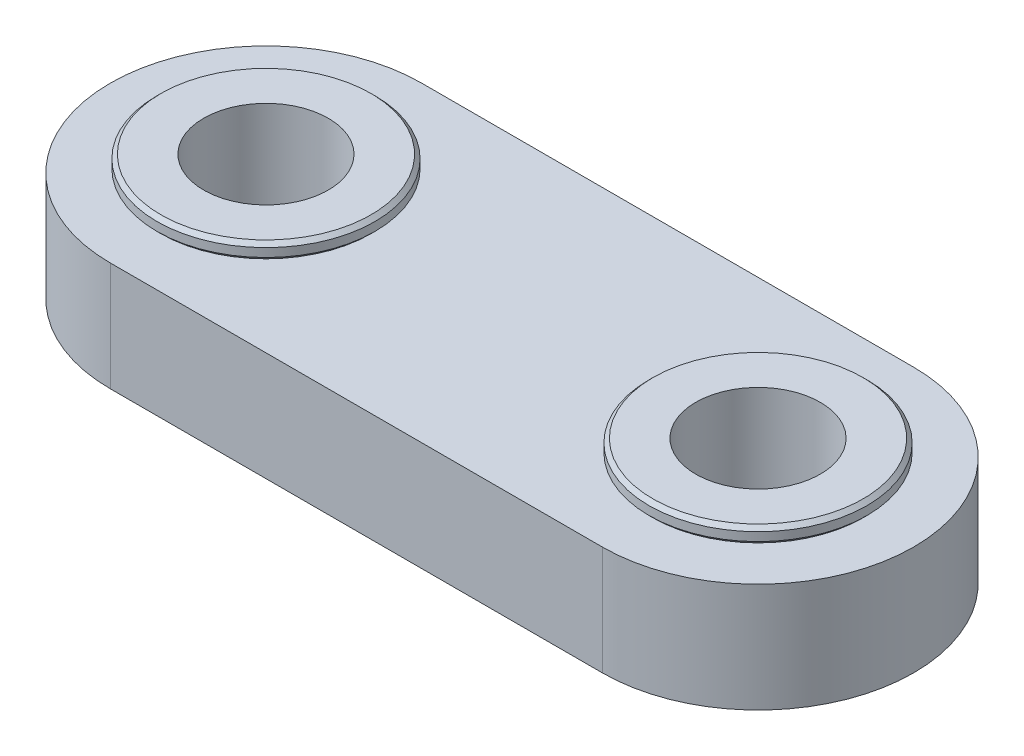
ISO-10303-21;
HEADER;
FILE_DESCRIPTION(('STEP AP214'),'2;1');
FILE_NAME('part.step','',(''),(''),'','','');
FILE_SCHEMA(('AUTOMOTIVE_DESIGN { 1 0 10303 214 1 1 1 1 }'));
ENDSEC;
DATA;
#1=APPLICATION_CONTEXT('core data for automotive mechanical design processes');
#2=APPLICATION_PROTOCOL_DEFINITION('international standard','automotive_design',2000,#1);
#3=PRODUCT_CONTEXT('',#1,'mechanical');
#4=PRODUCT('Part','Part','',(#3));
#5=PRODUCT_RELATED_PRODUCT_CATEGORY('part','',(#4));
#6=PRODUCT_DEFINITION_FORMATION('','',#4);
#7=PRODUCT_DEFINITION_CONTEXT('part definition',#1,'design');
#8=PRODUCT_DEFINITION('design','',#6,#7);
#9=PRODUCT_DEFINITION_SHAPE('','',#8);
#10=(LENGTH_UNIT() NAMED_UNIT(*) SI_UNIT(.MILLI.,.METRE.));
#11=(NAMED_UNIT(*) PLANE_ANGLE_UNIT() SI_UNIT($,.RADIAN.));
#12=(NAMED_UNIT(*) SI_UNIT($,.STERADIAN.) SOLID_ANGLE_UNIT());
#13=UNCERTAINTY_MEASURE_WITH_UNIT(LENGTH_MEASURE(1.E-05),#10,'distance_accuracy_value','');
#14=(GEOMETRIC_REPRESENTATION_CONTEXT(3) GLOBAL_UNCERTAINTY_ASSIGNED_CONTEXT((#13)) GLOBAL_UNIT_ASSIGNED_CONTEXT((#10,
#11,#12)) REPRESENTATION_CONTEXT('',''));
#15=CARTESIAN_POINT('',(0.,0.,0.));
#16=DIRECTION('',(0.,0.,1.));
#17=DIRECTION('',(1.,0.,0.));
#18=AXIS2_PLACEMENT_3D('',#15,#16,#17);
#19=CARTESIAN_POINT('',(0.,0.,0.));
#20=DIRECTION('',(0.,-1.,0.));
#21=DIRECTION('',(-1.,0.,0.));
#22=AXIS2_PLACEMENT_3D('',#19,#20,#21);
#23=CYLINDRICAL_SURFACE('',#22,10.);
#24=CARTESIAN_POINT('',(0.,-3.5,0.));
#25=DIRECTION('',(0.,1.,0.));
#26=DIRECTION('',(1.,0.,0.));
#27=AXIS2_PLACEMENT_3D('',#24,#25,#26);
#28=CIRCLE('',#27,10.);
#29=CARTESIAN_POINT('',(0.,-3.5,-10.));
#30=VERTEX_POINT('',#29);
#31=CARTESIAN_POINT('',(0.,-3.5,10.));
#32=VERTEX_POINT('',#31);
#33=EDGE_CURVE('E59',#30,#32,#28,.T.);
#34=ORIENTED_EDGE('',*,*,#33,.T.);
#35=DIRECTION('',(0.,-1.,0.));
#36=VECTOR('',#35,1.);
#37=CARTESIAN_POINT('',(0.,0.,10.));
#38=LINE('',#37,#36);
#39=CARTESIAN_POINT('',(0.,3.5,10.));
#40=VERTEX_POINT('',#39);
#41=EDGE_CURVE('E64',#40,#32,#38,.T.);
#42=ORIENTED_EDGE('',*,*,#41,.F.);
#43=CARTESIAN_POINT('',(0.,3.5,0.));
#44=DIRECTION('',(0.,1.,0.));
#45=DIRECTION('',(1.,0.,0.));
#46=AXIS2_PLACEMENT_3D('',#43,#44,#45);
#47=CIRCLE('',#46,10.);
#48=CARTESIAN_POINT('',(0.,3.5,-10.));
#49=VERTEX_POINT('',#48);
#50=EDGE_CURVE('E98',#49,#40,#47,.T.);
#51=ORIENTED_EDGE('',*,*,#50,.F.);
#52=DIRECTION('',(0.,-1.,0.));
#53=VECTOR('',#52,1.);
#54=CARTESIAN_POINT('',(0.,0.,-10.));
#55=LINE('',#54,#53);
#56=EDGE_CURVE('E66',#49,#30,#55,.T.);
#57=ORIENTED_EDGE('',*,*,#56,.T.);
#58=EDGE_LOOP('',(#34,#42,#51,#57));
#59=FACE_BOUND('',#58,.T.);
#60=ADVANCED_FACE('F14',(#59),#23,.T.);
#61=CARTESIAN_POINT('',(0.,0.,10.));
#62=DIRECTION('',(0.,0.,-1.));
#63=DIRECTION('',(0.,1.,0.));
#64=AXIS2_PLACEMENT_3D('',#61,#62,#63);
#65=PLANE('',#64);
#66=DIRECTION('',(1.,0.,0.));
#67=VECTOR('',#66,1.);
#68=CARTESIAN_POINT('',(0.,-3.5,10.));
#69=LINE('',#68,#67);
#70=CARTESIAN_POINT('',(31.6,-3.5,10.));
#71=VERTEX_POINT('',#70);
#72=EDGE_CURVE('E69',#32,#71,#69,.T.);
#73=ORIENTED_EDGE('',*,*,#72,.T.);
#74=DIRECTION('',(0.,-1.,0.));
#75=VECTOR('',#74,1.);
#76=CARTESIAN_POINT('',(31.6,0.,10.));
#77=LINE('',#76,#75);
#78=CARTESIAN_POINT('',(31.6,3.5,10.));
#79=VERTEX_POINT('',#78);
#80=EDGE_CURVE('E47',#79,#71,#77,.T.);
#81=ORIENTED_EDGE('',*,*,#80,.F.);
#82=DIRECTION('',(1.,0.,0.));
#83=VECTOR('',#82,1.);
#84=CARTESIAN_POINT('',(0.,3.5,10.));
#85=LINE('',#84,#83);
#86=EDGE_CURVE('E73',#40,#79,#85,.T.);
#87=ORIENTED_EDGE('',*,*,#86,.F.);
#88=ORIENTED_EDGE('',*,*,#41,.T.);
#89=EDGE_LOOP('',(#73,#81,#87,#88));
#90=FACE_BOUND('',#89,.T.);
#91=ADVANCED_FACE('F72',(#90),#65,.F.);
#92=CARTESIAN_POINT('',(31.6,0.,0.));
#93=DIRECTION('',(0.,-1.,0.));
#94=DIRECTION('',(-1.,0.,0.));
#95=AXIS2_PLACEMENT_3D('',#92,#93,#94);
#96=CYLINDRICAL_SURFACE('',#95,10.);
#97=CARTESIAN_POINT('',(31.6,-3.5,0.));
#98=DIRECTION('',(0.,1.,0.));
#99=DIRECTION('',(-1.,0.,0.));
#100=AXIS2_PLACEMENT_3D('',#97,#98,#99);
#101=CIRCLE('',#100,10.);
#102=CARTESIAN_POINT('',(31.6,-3.5,-10.));
#103=VERTEX_POINT('',#102);
#104=EDGE_CURVE('E31',#71,#103,#101,.T.);
#105=ORIENTED_EDGE('',*,*,#104,.T.);
#106=DIRECTION('',(0.,-1.,0.));
#107=VECTOR('',#106,1.);
#108=CARTESIAN_POINT('',(31.6,0.,-10.));
#109=LINE('',#108,#107);
#110=CARTESIAN_POINT('',(31.6,3.5,-10.));
#111=VERTEX_POINT('',#110);
#112=EDGE_CURVE('E51',#111,#103,#109,.T.);
#113=ORIENTED_EDGE('',*,*,#112,.F.);
#114=CARTESIAN_POINT('',(31.6,3.5,0.));
#115=DIRECTION('',(0.,1.,0.));
#116=DIRECTION('',(-1.,0.,0.));
#117=AXIS2_PLACEMENT_3D('',#114,#115,#116);
#118=CIRCLE('',#117,10.);
#119=EDGE_CURVE('E102',#79,#111,#118,.T.);
#120=ORIENTED_EDGE('',*,*,#119,.F.);
#121=ORIENTED_EDGE('',*,*,#80,.T.);
#122=EDGE_LOOP('',(#105,#113,#120,#121));
#123=FACE_BOUND('',#122,.T.);
#124=ADVANCED_FACE('F255',(#123),#96,.T.);
#125=CARTESIAN_POINT('',(31.6,0.,-10.));
#126=DIRECTION('',(0.,0.,1.));
#127=DIRECTION('',(0.,-1.,0.));
#128=AXIS2_PLACEMENT_3D('',#125,#126,#127);
#129=PLANE('',#128);
#130=DIRECTION('',(-1.,0.,0.));
#131=VECTOR('',#130,1.);
#132=CARTESIAN_POINT('',(31.6,-3.5,-10.));
#133=LINE('',#132,#131);
#134=EDGE_CURVE('E70',#103,#30,#133,.T.);
#135=ORIENTED_EDGE('',*,*,#134,.T.);
#136=ORIENTED_EDGE('',*,*,#56,.F.);
#137=DIRECTION('',(-1.,0.,0.));
#138=VECTOR('',#137,1.);
#139=CARTESIAN_POINT('',(31.6,3.5,-10.));
#140=LINE('',#139,#138);
#141=EDGE_CURVE('E100',#111,#49,#140,.T.);
#142=ORIENTED_EDGE('',*,*,#141,.F.);
#143=ORIENTED_EDGE('',*,*,#112,.T.);
#144=EDGE_LOOP('',(#135,#136,#142,#143));
#145=FACE_BOUND('',#144,.T.);
#146=ADVANCED_FACE('F252',(#145),#129,.F.);
#147=CARTESIAN_POINT('',(0.,-3.5,0.));
#148=DIRECTION('',(0.,1.,0.));
#149=DIRECTION('',(1.,0.,0.));
#150=AXIS2_PLACEMENT_3D('',#147,#148,#149);
#151=PLANE('',#150);
#152=CARTESIAN_POINT('',(31.6,-3.5,-4.44089209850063E-13));
#153=DIRECTION('',(0.,1.,0.));
#154=DIRECTION('',(1.,0.,0.));
#155=AXIS2_PLACEMENT_3D('',#152,#153,#154);
#156=CIRCLE('',#155,7.3);
#157=CARTESIAN_POINT('',(38.9,-3.5,-4.44089209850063E-13));
#158=VERTEX_POINT('',#157);
#159=EDGE_CURVE('E91',#158,#158,#156,.F.);
#160=ORIENTED_EDGE('',*,*,#159,.F.);
#161=EDGE_LOOP('',(#160));
#162=FACE_BOUND('',#161,.T.);
#163=ORIENTED_EDGE('',*,*,#134,.F.);
#164=ORIENTED_EDGE('',*,*,#104,.F.);
#165=ORIENTED_EDGE('',*,*,#72,.F.);
#166=ORIENTED_EDGE('',*,*,#33,.F.);
#167=EDGE_LOOP('',(#163,#164,#165,#166));
#168=FACE_BOUND('',#167,.T.);
#169=CARTESIAN_POINT('',(0.,-3.5,0.));
#170=DIRECTION('',(0.,1.,0.));
#171=DIRECTION('',(1.,0.,0.));
#172=AXIS2_PLACEMENT_3D('',#169,#170,#171);
#173=CIRCLE('',#172,7.3);
#174=CARTESIAN_POINT('',(7.3,-3.5,0.));
#175=VERTEX_POINT('',#174);
#176=EDGE_CURVE('E94',#175,#175,#173,.F.);
#177=ORIENTED_EDGE('',*,*,#176,.F.);
#178=EDGE_LOOP('',(#177));
#179=FACE_BOUND('',#178,.T.);
#180=ADVANCED_FACE('F75',(#162,#168,#179),#151,.F.);
#181=CARTESIAN_POINT('',(31.6,-3.5,-4.44089209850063E-13));
#182=DIRECTION('',(0.,-1.,0.));
#183=DIRECTION('',(1.,0.,0.));
#184=AXIS2_PLACEMENT_3D('',#181,#182,#183);
#185=CYLINDRICAL_SURFACE('',#184,7.5);
#186=CARTESIAN_POINT('',(31.6,-4.3,-4.44089209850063E-13));
#187=DIRECTION('',(0.,1.,0.));
#188=DIRECTION('',(1.,0.,0.));
#189=AXIS2_PLACEMENT_3D('',#186,#187,#188);
#190=CIRCLE('',#189,7.5);
#191=CARTESIAN_POINT('',(39.1,-4.3,-4.44089209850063E-13));
#192=VERTEX_POINT('',#191);
#193=EDGE_CURVE('E136',#192,#192,#190,.T.);
#194=ORIENTED_EDGE('',*,*,#193,.T.);
#195=EDGE_LOOP('',(#194));
#196=FACE_BOUND('',#195,.T.);
#197=CARTESIAN_POINT('',(31.6,-3.7,-4.44089209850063E-13));
#198=DIRECTION('',(0.,-1.,0.));
#199=DIRECTION('',(1.,0.,0.));
#200=AXIS2_PLACEMENT_3D('',#197,#198,#199);
#201=CIRCLE('',#200,7.5);
#202=CARTESIAN_POINT('',(39.1,-3.7,-4.44089209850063E-13));
#203=VERTEX_POINT('',#202);
#204=EDGE_CURVE('E120',#203,#203,#201,.T.);
#205=ORIENTED_EDGE('',*,*,#204,.T.);
#206=EDGE_LOOP('',(#205));
#207=FACE_BOUND('',#206,.T.);
#208=ADVANCED_FACE('F167',(#196,#207),#185,.T.);
#209=CARTESIAN_POINT('',(31.6,-3.5,-4.44089209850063E-13));
#210=DIRECTION('',(0.,-1.,0.));
#211=DIRECTION('',(1.,0.,0.));
#212=AXIS2_PLACEMENT_3D('',#209,#210,#211);
#213=CONICAL_SURFACE('',#212,7.3,0.785398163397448);
#214=ORIENTED_EDGE('',*,*,#204,.F.);
#215=EDGE_LOOP('',(#214));
#216=FACE_BOUND('',#215,.T.);
#217=ORIENTED_EDGE('',*,*,#159,.T.);
#218=EDGE_LOOP('',(#217));
#219=FACE_BOUND('',#218,.T.);
#220=ADVANCED_FACE('F164',(#216,#219),#213,.T.);
#221=CARTESIAN_POINT('',(0.,-3.5,0.));
#222=DIRECTION('',(0.,-1.,0.));
#223=DIRECTION('',(1.,0.,0.));
#224=AXIS2_PLACEMENT_3D('',#221,#222,#223);
#225=CYLINDRICAL_SURFACE('',#224,7.5);
#226=CARTESIAN_POINT('',(0.,-4.3,0.));
#227=DIRECTION('',(0.,1.,0.));
#228=DIRECTION('',(1.,0.,0.));
#229=AXIS2_PLACEMENT_3D('',#226,#227,#228);
#230=CIRCLE('',#229,7.5);
#231=CARTESIAN_POINT('',(7.5,-4.3,0.));
#232=VERTEX_POINT('',#231);
#233=EDGE_CURVE('E97',#232,#232,#230,.T.);
#234=ORIENTED_EDGE('',*,*,#233,.T.);
#235=EDGE_LOOP('',(#234));
#236=FACE_BOUND('',#235,.T.);
#237=CARTESIAN_POINT('',(0.,-3.7,0.));
#238=DIRECTION('',(0.,-1.,0.));
#239=DIRECTION('',(1.,0.,0.));
#240=AXIS2_PLACEMENT_3D('',#237,#238,#239);
#241=CIRCLE('',#240,7.5);
#242=CARTESIAN_POINT('',(7.5,-3.7,0.));
#243=VERTEX_POINT('',#242);
#244=EDGE_CURVE('E117',#243,#243,#241,.T.);
#245=ORIENTED_EDGE('',*,*,#244,.T.);
#246=EDGE_LOOP('',(#245));
#247=FACE_BOUND('',#246,.T.);
#248=ADVANCED_FACE('F166',(#236,#247),#225,.T.);
#249=CARTESIAN_POINT('',(0.,-3.5,0.));
#250=DIRECTION('',(0.,-1.,0.));
#251=DIRECTION('',(1.,0.,0.));
#252=AXIS2_PLACEMENT_3D('',#249,#250,#251);
#253=CONICAL_SURFACE('',#252,7.3,0.785398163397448);
#254=ORIENTED_EDGE('',*,*,#244,.F.);
#255=EDGE_LOOP('',(#254));
#256=FACE_BOUND('',#255,.T.);
#257=ORIENTED_EDGE('',*,*,#176,.T.);
#258=EDGE_LOOP('',(#257));
#259=FACE_BOUND('',#258,.T.);
#260=ADVANCED_FACE('F175',(#256,#259),#253,.T.);
#261=CARTESIAN_POINT('',(0.,-4.6,0.));
#262=DIRECTION('',(0.,1.,0.));
#263=DIRECTION('',(-1.,0.,0.));
#264=AXIS2_PLACEMENT_3D('',#261,#262,#263);
#265=CYLINDRICAL_SURFACE('',#264,7.);
#266=CARTESIAN_POINT('',(0.,4.3,0.));
#267=DIRECTION('',(0.,-1.,0.));
#268=DIRECTION('',(-1.,0.,0.));
#269=AXIS2_PLACEMENT_3D('',#266,#267,#268);
#270=CIRCLE('',#269,7.);
#271=CARTESIAN_POINT('',(-7.,4.3,0.));
#272=VERTEX_POINT('',#271);
#273=EDGE_CURVE('E23',#272,#272,#270,.T.);
#274=ORIENTED_EDGE('',*,*,#273,.T.);
#275=EDGE_LOOP('',(#274));
#276=FACE_BOUND('',#275,.T.);
#277=CARTESIAN_POINT('',(0.,3.75,0.));
#278=DIRECTION('',(0.,1.,0.));
#279=DIRECTION('',(-1.,0.,0.));
#280=AXIS2_PLACEMENT_3D('',#277,#278,#279);
#281=CIRCLE('',#280,7.);
#282=CARTESIAN_POINT('',(-7.,3.75,0.));
#283=VERTEX_POINT('',#282);
#284=EDGE_CURVE('E107',#283,#283,#281,.T.);
#285=ORIENTED_EDGE('',*,*,#284,.T.);
#286=EDGE_LOOP('',(#285));
#287=FACE_BOUND('',#286,.T.);
#288=ADVANCED_FACE('F150',(#276,#287),#265,.T.);
#289=CARTESIAN_POINT('',(31.6,-4.6,-4.44089209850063E-13));
#290=DIRECTION('',(0.,1.,0.));
#291=DIRECTION('',(-1.,0.,0.));
#292=AXIS2_PLACEMENT_3D('',#289,#290,#291);
#293=CYLINDRICAL_SURFACE('',#292,7.);
#294=CARTESIAN_POINT('',(31.6,4.3,-4.44089209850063E-13));
#295=DIRECTION('',(0.,-1.,0.));
#296=DIRECTION('',(-1.,0.,0.));
#297=AXIS2_PLACEMENT_3D('',#294,#295,#296);
#298=CIRCLE('',#297,7.);
#299=CARTESIAN_POINT('',(24.6,4.3,-4.44089209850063E-13));
#300=VERTEX_POINT('',#299);
#301=EDGE_CURVE('E142',#300,#300,#298,.T.);
#302=ORIENTED_EDGE('',*,*,#301,.T.);
#303=EDGE_LOOP('',(#302));
#304=FACE_BOUND('',#303,.T.);
#305=CARTESIAN_POINT('',(31.6,3.75,-4.44089209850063E-13));
#306=DIRECTION('',(0.,1.,0.));
#307=DIRECTION('',(-1.,0.,0.));
#308=AXIS2_PLACEMENT_3D('',#305,#306,#307);
#309=CIRCLE('',#308,7.);
#310=CARTESIAN_POINT('',(24.6,3.75,-4.44089209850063E-13));
#311=VERTEX_POINT('',#310);
#312=EDGE_CURVE('E114',#311,#311,#309,.T.);
#313=ORIENTED_EDGE('',*,*,#312,.T.);
#314=EDGE_LOOP('',(#313));
#315=FACE_BOUND('',#314,.T.);
#316=ADVANCED_FACE('F223',(#304,#315),#293,.T.);
#317=CARTESIAN_POINT('',(0.,3.5,0.));
#318=DIRECTION('',(0.,1.,0.));
#319=DIRECTION('',(-1.,0.,0.));
#320=AXIS2_PLACEMENT_3D('',#317,#318,#319);
#321=CONICAL_SURFACE('',#320,6.75,0.785398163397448);
#322=ORIENTED_EDGE('',*,*,#284,.F.);
#323=EDGE_LOOP('',(#322));
#324=FACE_BOUND('',#323,.T.);
#325=CARTESIAN_POINT('',(0.,3.5,0.));
#326=DIRECTION('',(0.,1.,0.));
#327=DIRECTION('',(1.,0.,0.));
#328=AXIS2_PLACEMENT_3D('',#325,#326,#327);
#329=CIRCLE('',#328,6.75);
#330=CARTESIAN_POINT('',(6.75,3.5,0.));
#331=VERTEX_POINT('',#330);
#332=EDGE_CURVE('E87',#331,#331,#329,.F.);
#333=ORIENTED_EDGE('',*,*,#332,.F.);
#334=EDGE_LOOP('',(#333));
#335=FACE_BOUND('',#334,.T.);
#336=ADVANCED_FACE('F219',(#324,#335),#321,.T.);
#337=CARTESIAN_POINT('',(31.6,3.5,-4.44089209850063E-13));
#338=DIRECTION('',(0.,1.,0.));
#339=DIRECTION('',(-1.,0.,0.));
#340=AXIS2_PLACEMENT_3D('',#337,#338,#339);
#341=CONICAL_SURFACE('',#340,6.75,0.785398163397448);
#342=ORIENTED_EDGE('',*,*,#312,.F.);
#343=EDGE_LOOP('',(#342));
#344=FACE_BOUND('',#343,.T.);
#345=CARTESIAN_POINT('',(31.6,3.5,-4.44089209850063E-13));
#346=DIRECTION('',(0.,1.,0.));
#347=DIRECTION('',(1.,0.,0.));
#348=AXIS2_PLACEMENT_3D('',#345,#346,#347);
#349=CIRCLE('',#348,6.75);
#350=CARTESIAN_POINT('',(38.35,3.5,-4.44089209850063E-13));
#351=VERTEX_POINT('',#350);
#352=EDGE_CURVE('E104',#351,#351,#349,.F.);
#353=ORIENTED_EDGE('',*,*,#352,.F.);
#354=EDGE_LOOP('',(#353));
#355=FACE_BOUND('',#354,.T.);
#356=ADVANCED_FACE('F212',(#344,#355),#341,.T.);
#357=CARTESIAN_POINT('',(0.,3.5,0.));
#358=DIRECTION('',(0.,1.,0.));
#359=DIRECTION('',(1.,0.,0.));
#360=AXIS2_PLACEMENT_3D('',#357,#358,#359);
#361=PLANE('',#360);
#362=ORIENTED_EDGE('',*,*,#352,.T.);
#363=EDGE_LOOP('',(#362));
#364=FACE_BOUND('',#363,.T.);
#365=ORIENTED_EDGE('',*,*,#141,.T.);
#366=ORIENTED_EDGE('',*,*,#50,.T.);
#367=ORIENTED_EDGE('',*,*,#86,.T.);
#368=ORIENTED_EDGE('',*,*,#119,.T.);
#369=EDGE_LOOP('',(#365,#366,#367,#368));
#370=FACE_BOUND('',#369,.T.);
#371=ORIENTED_EDGE('',*,*,#332,.T.);
#372=EDGE_LOOP('',(#371));
#373=FACE_BOUND('',#372,.T.);
#374=ADVANCED_FACE('F206',(#364,#370,#373),#361,.T.);
#375=CARTESIAN_POINT('',(0.,-4.6,0.));
#376=DIRECTION('',(0.,1.,0.));
#377=DIRECTION('',(-1.,0.,0.));
#378=AXIS2_PLACEMENT_3D('',#375,#376,#377);
#379=CYLINDRICAL_SURFACE('',#378,4.);
#380=CARTESIAN_POINT('',(0.,4.55,0.));
#381=DIRECTION('',(0.,-1.,0.));
#382=DIRECTION('',(-1.,0.,0.));
#383=AXIS2_PLACEMENT_3D('',#380,#381,#382);
#384=CIRCLE('',#383,4.);
#385=CARTESIAN_POINT('',(-4.,4.55,0.));
#386=VERTEX_POINT('',#385);
#387=EDGE_CURVE('E127',#386,#386,#384,.F.);
#388=ORIENTED_EDGE('',*,*,#387,.T.);
#389=EDGE_LOOP('',(#388));
#390=FACE_BOUND('',#389,.T.);
#391=CARTESIAN_POINT('',(0.,-4.55,0.));
#392=DIRECTION('',(0.,1.,0.));
#393=DIRECTION('',(1.,0.,0.));
#394=AXIS2_PLACEMENT_3D('',#391,#392,#393);
#395=CIRCLE('',#394,4.);
#396=CARTESIAN_POINT('',(4.,-4.55,0.));
#397=VERTEX_POINT('',#396);
#398=EDGE_CURVE('E123',#397,#397,#395,.F.);
#399=ORIENTED_EDGE('',*,*,#398,.T.);
#400=EDGE_LOOP('',(#399));
#401=FACE_BOUND('',#400,.T.);
#402=ADVANCED_FACE('F178',(#390,#401),#379,.F.);
#403=CARTESIAN_POINT('',(31.6,-4.6,-4.44089209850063E-13));
#404=DIRECTION('',(0.,1.,0.));
#405=DIRECTION('',(-1.,0.,0.));
#406=AXIS2_PLACEMENT_3D('',#403,#404,#405);
#407=CYLINDRICAL_SURFACE('',#406,4.);
#408=CARTESIAN_POINT('',(31.6,4.55,-4.44089209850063E-13));
#409=DIRECTION('',(0.,-1.,0.));
#410=DIRECTION('',(-1.,0.,0.));
#411=AXIS2_PLACEMENT_3D('',#408,#409,#410);
#412=CIRCLE('',#411,4.);
#413=CARTESIAN_POINT('',(27.6,4.55,-4.44089209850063E-13));
#414=VERTEX_POINT('',#413);
#415=EDGE_CURVE('E128',#414,#414,#412,.F.);
#416=ORIENTED_EDGE('',*,*,#415,.T.);
#417=EDGE_LOOP('',(#416));
#418=FACE_BOUND('',#417,.T.);
#419=CARTESIAN_POINT('',(31.6,-4.55,-4.44089209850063E-13));
#420=DIRECTION('',(0.,1.,0.));
#421=DIRECTION('',(1.,0.,0.));
#422=AXIS2_PLACEMENT_3D('',#419,#420,#421);
#423=CIRCLE('',#422,4.);
#424=CARTESIAN_POINT('',(35.6,-4.55,-4.44089209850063E-13));
#425=VERTEX_POINT('',#424);
#426=EDGE_CURVE('E124',#425,#425,#423,.F.);
#427=ORIENTED_EDGE('',*,*,#426,.T.);
#428=EDGE_LOOP('',(#427));
#429=FACE_BOUND('',#428,.T.);
#430=ADVANCED_FACE('F204',(#418,#429),#407,.F.);
#431=CARTESIAN_POINT('',(-9.02572077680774,-4.55,10.));
#432=DIRECTION('',(0.,1.,0.));
#433=DIRECTION('',(1.,0.,0.));
#434=AXIS2_PLACEMENT_3D('',#431,#432,#433);
#435=PLANE('',#434);
#436=CARTESIAN_POINT('',(31.6,-4.55,-4.44089209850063E-13));
#437=DIRECTION('',(0.,1.,0.));
#438=DIRECTION('',(1.,0.,0.));
#439=AXIS2_PLACEMENT_3D('',#436,#437,#438);
#440=CIRCLE('',#439,7.25);
#441=CARTESIAN_POINT('',(38.85,-4.55,-4.44089209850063E-13));
#442=VERTEX_POINT('',#441);
#443=EDGE_CURVE('E139',#442,#442,#440,.F.);
#444=ORIENTED_EDGE('',*,*,#443,.T.);
#445=EDGE_LOOP('',(#444));
#446=FACE_BOUND('',#445,.T.);
#447=ORIENTED_EDGE('',*,*,#426,.F.);
#448=EDGE_LOOP('',(#447));
#449=FACE_BOUND('',#448,.T.);
#450=ADVANCED_FACE('F200',(#446,#449),#435,.F.);
#451=CARTESIAN_POINT('',(0.,-4.55,0.));
#452=DIRECTION('',(0.,1.,0.));
#453=DIRECTION('',(1.,0.,0.));
#454=AXIS2_PLACEMENT_3D('',#451,#452,#453);
#455=CIRCLE('',#454,7.25);
#456=CARTESIAN_POINT('',(7.25,-4.55,0.));
#457=VERTEX_POINT('',#456);
#458=EDGE_CURVE('E133',#457,#457,#455,.F.);
#459=ORIENTED_EDGE('',*,*,#458,.T.);
#460=EDGE_LOOP('',(#459));
#461=FACE_BOUND('',#460,.T.);
#462=ORIENTED_EDGE('',*,*,#398,.F.);
#463=EDGE_LOOP('',(#462));
#464=FACE_BOUND('',#463,.T.);
#465=ADVANCED_FACE('F203',(#461,#464),#435,.F.);
#466=CARTESIAN_POINT('',(-9.02572077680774,4.55,10.));
#467=DIRECTION('',(0.,-1.,0.));
#468=DIRECTION('',(-1.,0.,0.));
#469=AXIS2_PLACEMENT_3D('',#466,#467,#468);
#470=PLANE('',#469);
#471=CARTESIAN_POINT('',(31.6,4.55,-4.44089209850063E-13));
#472=DIRECTION('',(0.,-1.,0.));
#473=DIRECTION('',(-1.,0.,0.));
#474=AXIS2_PLACEMENT_3D('',#471,#472,#473);
#475=CIRCLE('',#474,6.75);
#476=CARTESIAN_POINT('',(24.85,4.55,-4.44089209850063E-13));
#477=VERTEX_POINT('',#476);
#478=EDGE_CURVE('E145',#477,#477,#475,.F.);
#479=ORIENTED_EDGE('',*,*,#478,.T.);
#480=EDGE_LOOP('',(#479));
#481=FACE_BOUND('',#480,.T.);
#482=ORIENTED_EDGE('',*,*,#415,.F.);
#483=EDGE_LOOP('',(#482));
#484=FACE_BOUND('',#483,.T.);
#485=ADVANCED_FACE('F267',(#481,#484),#470,.F.);
#486=CARTESIAN_POINT('',(0.,4.55,0.));
#487=DIRECTION('',(0.,-1.,0.));
#488=DIRECTION('',(-1.,0.,0.));
#489=AXIS2_PLACEMENT_3D('',#486,#487,#488);
#490=CIRCLE('',#489,6.75);
#491=CARTESIAN_POINT('',(-6.75,4.55,0.));
#492=VERTEX_POINT('',#491);
#493=EDGE_CURVE('E9',#492,#492,#490,.F.);
#494=ORIENTED_EDGE('',*,*,#493,.T.);
#495=EDGE_LOOP('',(#494));
#496=FACE_BOUND('',#495,.T.);
#497=ORIENTED_EDGE('',*,*,#387,.F.);
#498=EDGE_LOOP('',(#497));
#499=FACE_BOUND('',#498,.T.);
#500=ADVANCED_FACE('F188',(#496,#499),#470,.F.);
#501=CARTESIAN_POINT('',(0.,-4.3,0.));
#502=DIRECTION('',(0.,1.,0.));
#503=DIRECTION('',(1.,0.,0.));
#504=AXIS2_PLACEMENT_3D('',#501,#502,#503);
#505=CONICAL_SURFACE('',#504,7.5,0.78539816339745);
#506=ORIENTED_EDGE('',*,*,#458,.F.);
#507=EDGE_LOOP('',(#506));
#508=FACE_BOUND('',#507,.T.);
#509=ORIENTED_EDGE('',*,*,#233,.F.);
#510=EDGE_LOOP('',(#509));
#511=FACE_BOUND('',#510,.T.);
#512=ADVANCED_FACE('F185',(#508,#511),#505,.T.);
#513=CARTESIAN_POINT('',(31.6,-4.3,-4.44089209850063E-13));
#514=DIRECTION('',(0.,1.,0.));
#515=DIRECTION('',(1.,0.,0.));
#516=AXIS2_PLACEMENT_3D('',#513,#514,#515);
#517=CONICAL_SURFACE('',#516,7.5,0.78539816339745);
#518=ORIENTED_EDGE('',*,*,#443,.F.);
#519=EDGE_LOOP('',(#518));
#520=FACE_BOUND('',#519,.T.);
#521=ORIENTED_EDGE('',*,*,#193,.F.);
#522=EDGE_LOOP('',(#521));
#523=FACE_BOUND('',#522,.T.);
#524=ADVANCED_FACE('F161',(#520,#523),#517,.T.);
#525=CARTESIAN_POINT('',(31.6,4.3,-4.44089209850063E-13));
#526=DIRECTION('',(0.,-1.,0.));
#527=DIRECTION('',(-1.,0.,0.));
#528=AXIS2_PLACEMENT_3D('',#525,#526,#527);
#529=CONICAL_SURFACE('',#528,7.,0.785398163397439);
#530=ORIENTED_EDGE('',*,*,#478,.F.);
#531=EDGE_LOOP('',(#530));
#532=FACE_BOUND('',#531,.T.);
#533=ORIENTED_EDGE('',*,*,#301,.F.);
#534=EDGE_LOOP('',(#533));
#535=FACE_BOUND('',#534,.T.);
#536=ADVANCED_FACE('F154',(#532,#535),#529,.T.);
#537=CARTESIAN_POINT('',(0.,4.3,0.));
#538=DIRECTION('',(0.,-1.,0.));
#539=DIRECTION('',(-1.,0.,0.));
#540=AXIS2_PLACEMENT_3D('',#537,#538,#539);
#541=CONICAL_SURFACE('',#540,7.,0.785398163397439);
#542=ORIENTED_EDGE('',*,*,#493,.F.);
#543=EDGE_LOOP('',(#542));
#544=FACE_BOUND('',#543,.T.);
#545=ORIENTED_EDGE('',*,*,#273,.F.);
#546=EDGE_LOOP('',(#545));
#547=FACE_BOUND('',#546,.T.);
#548=ADVANCED_FACE('F16',(#544,#547),#541,.T.);
#549=CLOSED_SHELL('',(#60,#91,#124,#146,#180,#208,#220,#248,#260,#288,#316,#336,#356,#374,#402,
#430,#450,#465,#485,#500,#512,#524,#536,#548));
#550=MANIFOLD_SOLID_BREP('B1',#549);
#551=ADVANCED_BREP_SHAPE_REPRESENTATION('',(#18,#550),#14);
#552=SHAPE_DEFINITION_REPRESENTATION(#9,#551);
ENDSEC;
END-ISO-10303-21;
